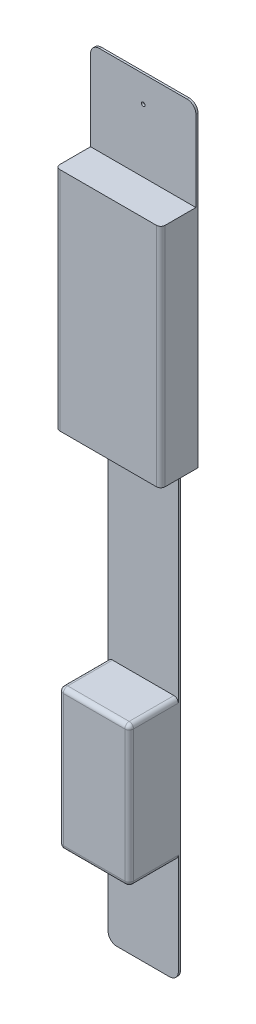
ISO-10303-21;
HEADER;
FILE_DESCRIPTION(('STEP AP214'),'2;1');
FILE_NAME('part.step','',(''),(''),'','','');
FILE_SCHEMA(('AUTOMOTIVE_DESIGN { 1 0 10303 214 1 1 1 1 }'));
ENDSEC;
DATA;
#1=APPLICATION_CONTEXT('core data for automotive mechanical design processes');
#2=APPLICATION_PROTOCOL_DEFINITION('international standard','automotive_design',2000,#1);
#3=PRODUCT_CONTEXT('',#1,'mechanical');
#4=PRODUCT('Part','Part','',(#3));
#5=PRODUCT_RELATED_PRODUCT_CATEGORY('part','',(#4));
#6=PRODUCT_DEFINITION_FORMATION('','',#4);
#7=PRODUCT_DEFINITION_CONTEXT('part definition',#1,'design');
#8=PRODUCT_DEFINITION('design','',#6,#7);
#9=PRODUCT_DEFINITION_SHAPE('','',#8);
#10=(LENGTH_UNIT() NAMED_UNIT(*) SI_UNIT(.MILLI.,.METRE.));
#11=(NAMED_UNIT(*) PLANE_ANGLE_UNIT() SI_UNIT($,.RADIAN.));
#12=(NAMED_UNIT(*) SI_UNIT($,.STERADIAN.) SOLID_ANGLE_UNIT());
#13=UNCERTAINTY_MEASURE_WITH_UNIT(LENGTH_MEASURE(1.E-05),#10,'distance_accuracy_value','');
#14=(GEOMETRIC_REPRESENTATION_CONTEXT(3) GLOBAL_UNCERTAINTY_ASSIGNED_CONTEXT((#13)) GLOBAL_UNIT_ASSIGNED_CONTEXT((#10,
#11,#12)) REPRESENTATION_CONTEXT('',''));
#15=CARTESIAN_POINT('',(0.,0.,0.));
#16=DIRECTION('',(0.,0.,1.));
#17=DIRECTION('',(1.,0.,0.));
#18=AXIS2_PLACEMENT_3D('',#15,#16,#17);
#19=CARTESIAN_POINT('',(0.,0.,1.524));
#20=DIRECTION('',(0.,0.,-1.));
#21=DIRECTION('',(-1.,0.,0.));
#22=AXIS2_PLACEMENT_3D('',#19,#20,#21);
#23=PLANE('',#22);
#24=CARTESIAN_POINT('',(0.,-501.65,1.524));
#25=DIRECTION('',(0.,0.,-1.));
#26=DIRECTION('',(-1.,0.,0.));
#27=AXIS2_PLACEMENT_3D('',#24,#25,#26);
#28=CIRCLE('',#27,1.35255);
#29=CARTESIAN_POINT('',(-1.35255,-501.65,1.524));
#30=VERTEX_POINT('',#29);
#31=EDGE_CURVE('E373',#30,#30,#28,.T.);
#32=ORIENTED_EDGE('',*,*,#31,.T.);
#33=EDGE_LOOP('',(#32));
#34=FACE_BOUND('',#33,.T.);
#35=DIRECTION('',(1.,0.,0.));
#36=VECTOR('',#35,1.);
#37=CARTESIAN_POINT('',(25.4,-480.06,1.524));
#38=LINE('',#37,#36);
#39=CARTESIAN_POINT('',(-22.225,-480.06,1.524));
#40=VERTEX_POINT('',#39);
#41=CARTESIAN_POINT('',(22.225,-480.06,1.524));
#42=VERTEX_POINT('',#41);
#43=EDGE_CURVE('E404',#40,#42,#38,.T.);
#44=ORIENTED_EDGE('',*,*,#43,.F.);
#45=CARTESIAN_POINT('',(-22.225,-476.885,1.524));
#46=DIRECTION('',(0.,0.,-1.));
#47=DIRECTION('',(-1.,0.,0.));
#48=AXIS2_PLACEMENT_3D('',#45,#46,#47);
#49=CIRCLE('',#48,3.175);
#50=CARTESIAN_POINT('',(-25.4,-476.885,1.524));
#51=VERTEX_POINT('',#50);
#52=EDGE_CURVE('E363',#40,#51,#49,.T.);
#53=ORIENTED_EDGE('',*,*,#52,.T.);
#54=DIRECTION('',(0.,-1.,0.));
#55=VECTOR('',#54,1.);
#56=CARTESIAN_POINT('',(-25.4,-556.26,1.524));
#57=LINE('',#56,#55);
#58=CARTESIAN_POINT('',(-25.4,-549.91,1.524));
#59=VERTEX_POINT('',#58);
#60=EDGE_CURVE('E238',#51,#59,#57,.T.);
#61=ORIENTED_EDGE('',*,*,#60,.T.);
#62=CARTESIAN_POINT('',(-19.05,-549.91,1.524));
#63=DIRECTION('',(0.,0.,-1.));
#64=DIRECTION('',(-1.,0.,0.));
#65=AXIS2_PLACEMENT_3D('',#62,#63,#64);
#66=CIRCLE('',#65,6.35);
#67=CARTESIAN_POINT('',(-19.05,-556.26,1.524));
#68=VERTEX_POINT('',#67);
#69=EDGE_CURVE('E298',#59,#68,#66,.F.);
#70=ORIENTED_EDGE('',*,*,#69,.T.);
#71=DIRECTION('',(1.,0.,0.));
#72=VECTOR('',#71,1.);
#73=CARTESIAN_POINT('',(25.4,-556.26,1.524));
#74=LINE('',#73,#72);
#75=CARTESIAN_POINT('',(19.05,-556.26,1.524));
#76=VERTEX_POINT('',#75);
#77=EDGE_CURVE('E237',#68,#76,#74,.T.);
#78=ORIENTED_EDGE('',*,*,#77,.T.);
#79=CARTESIAN_POINT('',(19.05,-549.91,1.524));
#80=DIRECTION('',(0.,0.,-1.));
#81=DIRECTION('',(-1.,0.,0.));
#82=AXIS2_PLACEMENT_3D('',#79,#80,#81);
#83=CIRCLE('',#82,6.35);
#84=CARTESIAN_POINT('',(25.4,-549.91,1.524));
#85=VERTEX_POINT('',#84);
#86=EDGE_CURVE('E300',#76,#85,#83,.F.);
#87=ORIENTED_EDGE('',*,*,#86,.T.);
#88=DIRECTION('',(0.,1.,0.));
#89=VECTOR('',#88,1.);
#90=CARTESIAN_POINT('',(25.4,-228.6,1.524));
#91=LINE('',#90,#89);
#92=CARTESIAN_POINT('',(25.4,-476.885,1.524));
#93=VERTEX_POINT('',#92);
#94=EDGE_CURVE('E246',#85,#93,#91,.T.);
#95=ORIENTED_EDGE('',*,*,#94,.T.);
#96=CARTESIAN_POINT('',(22.225,-476.885,1.524));
#97=DIRECTION('',(0.,0.,-1.));
#98=DIRECTION('',(-1.,0.,0.));
#99=AXIS2_PLACEMENT_3D('',#96,#97,#98);
#100=CIRCLE('',#99,3.175);
#101=EDGE_CURVE('E42',#93,#42,#100,.T.);
#102=ORIENTED_EDGE('',*,*,#101,.T.);
#103=EDGE_LOOP('',(#44,#53,#61,#70,#78,#87,#95,#102));
#104=FACE_BOUND('',#103,.T.);
#105=ADVANCED_FACE('F33',(#34,#104),#23,.F.);
#106=DIRECTION('',(-1.,0.,0.));
#107=VECTOR('',#106,1.);
#108=CARTESIAN_POINT('',(-25.4,-378.46,1.524));
#109=LINE('',#108,#107);
#110=CARTESIAN_POINT('',(22.225,-378.46,1.524));
#111=VERTEX_POINT('',#110);
#112=CARTESIAN_POINT('',(-22.225,-378.46,1.524));
#113=VERTEX_POINT('',#112);
#114=EDGE_CURVE('E409',#111,#113,#109,.T.);
#115=ORIENTED_EDGE('',*,*,#114,.F.);
#116=CARTESIAN_POINT('',(22.225,-381.635,1.524));
#117=DIRECTION('',(0.,0.,-1.));
#118=DIRECTION('',(-1.,0.,0.));
#119=AXIS2_PLACEMENT_3D('',#116,#117,#118);
#120=CIRCLE('',#119,3.175);
#121=CARTESIAN_POINT('',(25.4,-381.635,1.524));
#122=VERTEX_POINT('',#121);
#123=EDGE_CURVE('E11',#111,#122,#120,.T.);
#124=ORIENTED_EDGE('',*,*,#123,.T.);
#125=CARTESIAN_POINT('',(25.4,-228.6,1.524));
#126=VERTEX_POINT('',#125);
#127=EDGE_CURVE('E214',#122,#126,#91,.T.);
#128=ORIENTED_EDGE('',*,*,#127,.T.);
#129=DIRECTION('',(1.,0.,0.));
#130=VECTOR('',#129,1.);
#131=CARTESIAN_POINT('',(38.1000000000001,-228.6,1.524));
#132=LINE('',#131,#130);
#133=CARTESIAN_POINT('',(-25.4,-228.6,1.524));
#134=VERTEX_POINT('',#133);
#135=EDGE_CURVE('E207',#134,#126,#132,.T.);
#136=ORIENTED_EDGE('',*,*,#135,.F.);
#137=CARTESIAN_POINT('',(-25.4,-381.635,1.524));
#138=VERTEX_POINT('',#137);
#139=EDGE_CURVE('E212',#134,#138,#57,.T.);
#140=ORIENTED_EDGE('',*,*,#139,.T.);
#141=CARTESIAN_POINT('',(-22.225,-381.635,1.524));
#142=DIRECTION('',(0.,0.,-1.));
#143=DIRECTION('',(-1.,0.,0.));
#144=AXIS2_PLACEMENT_3D('',#141,#142,#143);
#145=CIRCLE('',#144,3.175);
#146=EDGE_CURVE('E366',#138,#113,#145,.T.);
#147=ORIENTED_EDGE('',*,*,#146,.T.);
#148=EDGE_LOOP('',(#115,#124,#128,#136,#140,#147));
#149=FACE_BOUND('',#148,.T.);
#150=ADVANCED_FACE('F210',(#149),#23,.F.);
#151=CARTESIAN_POINT('',(0.,-19.05,1.524));
#152=DIRECTION('',(0.,0.,-1.));
#153=DIRECTION('',(-1.,0.,0.));
#154=AXIS2_PLACEMENT_3D('',#151,#152,#153);
#155=CIRCLE('',#154,1.35255);
#156=CARTESIAN_POINT('',(-1.35255,-19.05,1.524));
#157=VERTEX_POINT('',#156);
#158=EDGE_CURVE('E561',#157,#157,#155,.T.);
#159=ORIENTED_EDGE('',*,*,#158,.T.);
#160=EDGE_LOOP('',(#159));
#161=FACE_BOUND('',#160,.T.);
#162=DIRECTION('',(-1.,0.,0.));
#163=VECTOR('',#162,1.);
#164=CARTESIAN_POINT('',(-38.1,-64.77,1.524));
#165=LINE('',#164,#163);
#166=CARTESIAN_POINT('',(38.1,-64.77,1.524));
#167=VERTEX_POINT('',#166);
#168=CARTESIAN_POINT('',(-38.1,-64.77,1.524));
#169=VERTEX_POINT('',#168);
#170=EDGE_CURVE('E415',#167,#169,#165,.T.);
#171=ORIENTED_EDGE('',*,*,#170,.F.);
#172=DIRECTION('',(0.,1.,0.));
#173=VECTOR('',#172,1.);
#174=CARTESIAN_POINT('',(38.1,0.,1.524));
#175=LINE('',#174,#173);
#176=CARTESIAN_POINT('',(38.1,-6.34999999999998,1.524));
#177=VERTEX_POINT('',#176);
#178=EDGE_CURVE('E248',#167,#177,#175,.T.);
#179=ORIENTED_EDGE('',*,*,#178,.T.);
#180=CARTESIAN_POINT('',(31.75,-6.34999999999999,1.524));
#181=DIRECTION('',(0.,0.,-1.));
#182=DIRECTION('',(-1.,0.,0.));
#183=AXIS2_PLACEMENT_3D('',#180,#181,#182);
#184=CIRCLE('',#183,6.35);
#185=CARTESIAN_POINT('',(31.75,0.,1.524));
#186=VERTEX_POINT('',#185);
#187=EDGE_CURVE('E294',#177,#186,#184,.F.);
#188=ORIENTED_EDGE('',*,*,#187,.T.);
#189=DIRECTION('',(-1.,0.,0.));
#190=VECTOR('',#189,1.);
#191=CARTESIAN_POINT('',(-38.1,0.,1.524));
#192=LINE('',#191,#190);
#193=CARTESIAN_POINT('',(-31.75,0.,1.524));
#194=VERTEX_POINT('',#193);
#195=EDGE_CURVE('E250',#186,#194,#192,.T.);
#196=ORIENTED_EDGE('',*,*,#195,.T.);
#197=CARTESIAN_POINT('',(-31.75,-6.34999999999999,1.524));
#198=DIRECTION('',(0.,0.,-1.));
#199=DIRECTION('',(-1.,0.,0.));
#200=AXIS2_PLACEMENT_3D('',#197,#198,#199);
#201=CIRCLE('',#200,6.35);
#202=CARTESIAN_POINT('',(-38.1,-6.34999999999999,1.524));
#203=VERTEX_POINT('',#202);
#204=EDGE_CURVE('E296',#194,#203,#201,.F.);
#205=ORIENTED_EDGE('',*,*,#204,.T.);
#206=DIRECTION('',(0.,-1.,0.));
#207=VECTOR('',#206,1.);
#208=CARTESIAN_POINT('',(-38.1,-228.6,1.524));
#209=LINE('',#208,#207);
#210=EDGE_CURVE('E242',#203,#169,#209,.T.);
#211=ORIENTED_EDGE('',*,*,#210,.T.);
#212=EDGE_LOOP('',(#171,#179,#188,#196,#205,#211));
#213=FACE_BOUND('',#212,.T.);
#214=ADVANCED_FACE('F440',(#161,#213),#23,.F.);
#215=CARTESIAN_POINT('',(-38.1,-228.6,1.524));
#216=DIRECTION('',(1.,0.,0.));
#217=DIRECTION('',(0.,0.,-1.));
#218=AXIS2_PLACEMENT_3D('',#215,#216,#217);
#219=PLANE('',#218);
#220=DIRECTION('',(0.,0.,-1.));
#221=VECTOR('',#220,1.);
#222=CARTESIAN_POINT('',(-38.1,-228.6,1.524));
#223=LINE('',#222,#221);
#224=CARTESIAN_POINT('',(-38.1,-228.6,23.749));
#225=VERTEX_POINT('',#224);
#226=CARTESIAN_POINT('',(-38.1,-228.6,0.));
#227=VERTEX_POINT('',#226);
#228=EDGE_CURVE('E230',#225,#227,#223,.T.);
#229=ORIENTED_EDGE('',*,*,#228,.F.);
#230=DIRECTION('',(0.,-1.,0.));
#231=VECTOR('',#230,1.);
#232=CARTESIAN_POINT('',(-38.1,-228.6,23.749));
#233=LINE('',#232,#231);
#234=CARTESIAN_POINT('',(-38.1,-64.77,23.749));
#235=VERTEX_POINT('',#234);
#236=EDGE_CURVE('E330',#225,#235,#233,.F.);
#237=ORIENTED_EDGE('',*,*,#236,.T.);
#238=DIRECTION('',(0.,0.,-1.));
#239=VECTOR('',#238,1.);
#240=CARTESIAN_POINT('',(-38.1,-64.77,26.924));
#241=LINE('',#240,#239);
#242=EDGE_CURVE('E425',#235,#169,#241,.T.);
#243=ORIENTED_EDGE('',*,*,#242,.T.);
#244=ORIENTED_EDGE('',*,*,#210,.F.);
#245=DIRECTION('',(0.,0.,-1.));
#246=VECTOR('',#245,1.);
#247=CARTESIAN_POINT('',(-38.1,-6.34999999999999,1.524));
#248=LINE('',#247,#246);
#249=CARTESIAN_POINT('',(-38.1,-6.34999999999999,0.));
#250=VERTEX_POINT('',#249);
#251=EDGE_CURVE('E305',#203,#250,#248,.T.);
#252=ORIENTED_EDGE('',*,*,#251,.T.);
#253=DIRECTION('',(0.,-1.,0.));
#254=VECTOR('',#253,1.);
#255=CARTESIAN_POINT('',(-38.1,-228.6,0.));
#256=LINE('',#255,#254);
#257=EDGE_CURVE('E254',#250,#227,#256,.T.);
#258=ORIENTED_EDGE('',*,*,#257,.T.);
#259=EDGE_LOOP('',(#229,#237,#243,#244,#252,#258));
#260=FACE_BOUND('',#259,.T.);
#261=ADVANCED_FACE('F460',(#260),#219,.F.);
#262=CARTESIAN_POINT('',(-25.4,-556.26,1.524));
#263=DIRECTION('',(1.,0.,0.));
#264=DIRECTION('',(0.,0.,-1.));
#265=AXIS2_PLACEMENT_3D('',#262,#263,#264);
#266=PLANE('',#265);
#267=DIRECTION('',(0.,0.,-1.));
#268=VECTOR('',#267,1.);
#269=CARTESIAN_POINT('',(-25.4,-381.635,1.524));
#270=LINE('',#269,#268);
#271=CARTESIAN_POINT('',(-25.4,-381.635,33.909));
#272=VERTEX_POINT('',#271);
#273=EDGE_CURVE('E235',#272,#138,#270,.T.);
#274=ORIENTED_EDGE('',*,*,#273,.T.);
#275=ORIENTED_EDGE('',*,*,#139,.F.);
#276=DIRECTION('',(0.,0.,-1.));
#277=VECTOR('',#276,1.);
#278=CARTESIAN_POINT('',(-25.4,-228.6,1.524));
#279=LINE('',#278,#277);
#280=CARTESIAN_POINT('',(-25.4,-228.6,0.));
#281=VERTEX_POINT('',#280);
#282=EDGE_CURVE('E222',#134,#281,#279,.T.);
#283=ORIENTED_EDGE('',*,*,#282,.T.);
#284=DIRECTION('',(0.,-1.,0.));
#285=VECTOR('',#284,1.);
#286=CARTESIAN_POINT('',(-25.4,-556.26,0.));
#287=LINE('',#286,#285);
#288=CARTESIAN_POINT('',(-25.4,-549.91,0.));
#289=VERTEX_POINT('',#288);
#290=EDGE_CURVE('E259',#281,#289,#287,.T.);
#291=ORIENTED_EDGE('',*,*,#290,.T.);
#292=DIRECTION('',(0.,0.,-1.));
#293=VECTOR('',#292,1.);
#294=CARTESIAN_POINT('',(-25.4,-549.91,1.524));
#295=LINE('',#294,#293);
#296=EDGE_CURVE('E302',#289,#59,#295,.F.);
#297=ORIENTED_EDGE('',*,*,#296,.T.);
#298=ORIENTED_EDGE('',*,*,#60,.F.);
#299=DIRECTION('',(0.,0.,-1.));
#300=VECTOR('',#299,1.);
#301=CARTESIAN_POINT('',(-25.4,-476.885,1.524));
#302=LINE('',#301,#300);
#303=CARTESIAN_POINT('',(-25.4,-476.885,33.909));
#304=VERTEX_POINT('',#303);
#305=EDGE_CURVE('E342',#51,#304,#302,.F.);
#306=ORIENTED_EDGE('',*,*,#305,.T.);
#307=DIRECTION('',(0.,-1.,0.));
#308=VECTOR('',#307,1.);
#309=CARTESIAN_POINT('',(-25.4,-556.26,33.909));
#310=LINE('',#309,#308);
#311=EDGE_CURVE('E339',#304,#272,#310,.F.);
#312=ORIENTED_EDGE('',*,*,#311,.T.);
#313=EDGE_LOOP('',(#274,#275,#283,#291,#297,#298,#306,#312));
#314=FACE_BOUND('',#313,.T.);
#315=ADVANCED_FACE('F233',(#314),#266,.F.);
#316=CARTESIAN_POINT('',(25.4,-556.26,1.524));
#317=DIRECTION('',(0.,1.,0.));
#318=DIRECTION('',(0.,0.,1.));
#319=AXIS2_PLACEMENT_3D('',#316,#317,#318);
#320=PLANE('',#319);
#321=DIRECTION('',(1.,0.,0.));
#322=VECTOR('',#321,1.);
#323=CARTESIAN_POINT('',(25.4,-556.26,0.));
#324=LINE('',#323,#322);
#325=CARTESIAN_POINT('',(-19.05,-556.26,0.));
#326=VERTEX_POINT('',#325);
#327=CARTESIAN_POINT('',(19.05,-556.26,0.));
#328=VERTEX_POINT('',#327);
#329=EDGE_CURVE('E261',#326,#328,#324,.T.);
#330=ORIENTED_EDGE('',*,*,#329,.T.);
#331=DIRECTION('',(0.,0.,-1.));
#332=VECTOR('',#331,1.);
#333=CARTESIAN_POINT('',(19.05,-556.26,1.524));
#334=LINE('',#333,#332);
#335=EDGE_CURVE('E292',#328,#76,#334,.F.);
#336=ORIENTED_EDGE('',*,*,#335,.T.);
#337=ORIENTED_EDGE('',*,*,#77,.F.);
#338=DIRECTION('',(0.,0.,-1.));
#339=VECTOR('',#338,1.);
#340=CARTESIAN_POINT('',(-19.05,-556.26,1.524));
#341=LINE('',#340,#339);
#342=EDGE_CURVE('E289',#68,#326,#341,.T.);
#343=ORIENTED_EDGE('',*,*,#342,.T.);
#344=EDGE_LOOP('',(#330,#336,#337,#343));
#345=FACE_BOUND('',#344,.T.);
#346=ADVANCED_FACE('F488',(#345),#320,.F.);
#347=CARTESIAN_POINT('',(25.4,-228.6,1.524));
#348=DIRECTION('',(-1.,0.,0.));
#349=DIRECTION('',(0.,-1.,0.));
#350=AXIS2_PLACEMENT_3D('',#347,#348,#349);
#351=PLANE('',#350);
#352=DIRECTION('',(0.,0.,-1.));
#353=VECTOR('',#352,1.);
#354=CARTESIAN_POINT('',(25.4,-476.885,1.524));
#355=LINE('',#354,#353);
#356=CARTESIAN_POINT('',(25.4,-476.885,33.909));
#357=VERTEX_POINT('',#356);
#358=EDGE_CURVE('E354',#357,#93,#355,.T.);
#359=ORIENTED_EDGE('',*,*,#358,.T.);
#360=ORIENTED_EDGE('',*,*,#94,.F.);
#361=DIRECTION('',(0.,0.,-1.));
#362=VECTOR('',#361,1.);
#363=CARTESIAN_POINT('',(25.4,-549.91,1.524));
#364=LINE('',#363,#362);
#365=CARTESIAN_POINT('',(25.4,-549.91,0.));
#366=VERTEX_POINT('',#365);
#367=EDGE_CURVE('E278',#85,#366,#364,.T.);
#368=ORIENTED_EDGE('',*,*,#367,.T.);
#369=DIRECTION('',(0.,1.,0.));
#370=VECTOR('',#369,1.);
#371=CARTESIAN_POINT('',(25.4,-228.6,0.));
#372=LINE('',#371,#370);
#373=CARTESIAN_POINT('',(25.4,-228.6,0.));
#374=VERTEX_POINT('',#373);
#375=EDGE_CURVE('E264',#366,#374,#372,.T.);
#376=ORIENTED_EDGE('',*,*,#375,.T.);
#377=DIRECTION('',(0.,0.,-1.));
#378=VECTOR('',#377,1.);
#379=CARTESIAN_POINT('',(25.4,-228.6,1.524));
#380=LINE('',#379,#378);
#381=EDGE_CURVE('E231',#126,#374,#380,.T.);
#382=ORIENTED_EDGE('',*,*,#381,.F.);
#383=ORIENTED_EDGE('',*,*,#127,.F.);
#384=DIRECTION('',(0.,0.,-1.));
#385=VECTOR('',#384,1.);
#386=CARTESIAN_POINT('',(25.4,-381.635,1.524));
#387=LINE('',#386,#385);
#388=CARTESIAN_POINT('',(25.4,-381.635,33.909));
#389=VERTEX_POINT('',#388);
#390=EDGE_CURVE('E350',#122,#389,#387,.F.);
#391=ORIENTED_EDGE('',*,*,#390,.T.);
#392=DIRECTION('',(0.,1.,0.));
#393=VECTOR('',#392,1.);
#394=CARTESIAN_POINT('',(25.4,-228.6,33.909));
#395=LINE('',#394,#393);
#396=EDGE_CURVE('E352',#389,#357,#395,.F.);
#397=ORIENTED_EDGE('',*,*,#396,.T.);
#398=EDGE_LOOP('',(#359,#360,#368,#376,#382,#383,#391,#397));
#399=FACE_BOUND('',#398,.T.);
#400=ADVANCED_FACE('F495',(#399),#351,.F.);
#401=CARTESIAN_POINT('',(38.1000000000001,-228.6,1.524));
#402=DIRECTION('',(0.,1.,0.));
#403=DIRECTION('',(-1.,0.,0.));
#404=AXIS2_PLACEMENT_3D('',#401,#402,#403);
#405=PLANE('',#404);
#406=DIRECTION('',(0.,0.,-1.));
#407=VECTOR('',#406,1.);
#408=CARTESIAN_POINT('',(38.1000000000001,-228.6,1.524));
#409=LINE('',#408,#407);
#410=CARTESIAN_POINT('',(38.1000000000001,-228.6,23.749));
#411=VERTEX_POINT('',#410);
#412=CARTESIAN_POINT('',(38.1000000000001,-228.6,0.));
#413=VERTEX_POINT('',#412);
#414=EDGE_CURVE('E253',#411,#413,#409,.T.);
#415=ORIENTED_EDGE('',*,*,#414,.F.);
#416=CARTESIAN_POINT('',(34.9250000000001,-228.6,23.749));
#417=DIRECTION('',(0.,1.,0.));
#418=DIRECTION('',(-1.,0.,0.));
#419=AXIS2_PLACEMENT_3D('',#416,#417,#418);
#420=CIRCLE('',#419,3.175);
#421=CARTESIAN_POINT('',(34.9250000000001,-228.6,26.924));
#422=VERTEX_POINT('',#421);
#423=EDGE_CURVE('E328',#411,#422,#420,.F.);
#424=ORIENTED_EDGE('',*,*,#423,.T.);
#425=DIRECTION('',(1.,0.,0.));
#426=VECTOR('',#425,1.);
#427=CARTESIAN_POINT('',(38.1000000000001,-228.6,26.924));
#428=LINE('',#427,#426);
#429=CARTESIAN_POINT('',(-34.925,-228.6,26.924));
#430=VERTEX_POINT('',#429);
#431=EDGE_CURVE('E420',#430,#422,#428,.T.);
#432=ORIENTED_EDGE('',*,*,#431,.F.);
#433=CARTESIAN_POINT('',(-34.925,-228.6,23.749));
#434=DIRECTION('',(0.,1.,0.));
#435=DIRECTION('',(-1.,0.,0.));
#436=AXIS2_PLACEMENT_3D('',#433,#434,#435);
#437=CIRCLE('',#436,3.175);
#438=EDGE_CURVE('E326',#430,#225,#437,.F.);
#439=ORIENTED_EDGE('',*,*,#438,.T.);
#440=ORIENTED_EDGE('',*,*,#228,.T.);
#441=DIRECTION('',(1.,0.,0.));
#442=VECTOR('',#441,1.);
#443=CARTESIAN_POINT('',(-25.4,-228.6,0.));
#444=LINE('',#443,#442);
#445=EDGE_CURVE('E226',#227,#281,#444,.T.);
#446=ORIENTED_EDGE('',*,*,#445,.T.);
#447=ORIENTED_EDGE('',*,*,#282,.F.);
#448=ORIENTED_EDGE('',*,*,#135,.T.);
#449=ORIENTED_EDGE('',*,*,#381,.T.);
#450=DIRECTION('',(1.,0.,0.));
#451=VECTOR('',#450,1.);
#452=CARTESIAN_POINT('',(38.1000000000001,-228.6,0.));
#453=LINE('',#452,#451);
#454=EDGE_CURVE('E266',#374,#413,#453,.T.);
#455=ORIENTED_EDGE('',*,*,#454,.T.);
#456=EDGE_LOOP('',(#415,#424,#432,#439,#440,#446,#447,#448,#449,#455));
#457=FACE_BOUND('',#456,.T.);
#458=ADVANCED_FACE('F224',(#457),#405,.F.);
#459=CARTESIAN_POINT('',(38.1,0.,1.524));
#460=DIRECTION('',(-1.,0.,0.));
#461=DIRECTION('',(0.,-1.,0.));
#462=AXIS2_PLACEMENT_3D('',#459,#460,#461);
#463=PLANE('',#462);
#464=DIRECTION('',(0.,0.,-1.));
#465=VECTOR('',#464,1.);
#466=CARTESIAN_POINT('',(38.1000000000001,-64.77,26.924));
#467=LINE('',#466,#465);
#468=CARTESIAN_POINT('',(38.1000000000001,-64.77,23.749));
#469=VERTEX_POINT('',#468);
#470=EDGE_CURVE('E257',#469,#167,#467,.T.);
#471=ORIENTED_EDGE('',*,*,#470,.F.);
#472=DIRECTION('',(0.,1.,0.));
#473=VECTOR('',#472,1.);
#474=CARTESIAN_POINT('',(38.1,0.,23.749));
#475=LINE('',#474,#473);
#476=EDGE_CURVE('E324',#469,#411,#475,.F.);
#477=ORIENTED_EDGE('',*,*,#476,.T.);
#478=ORIENTED_EDGE('',*,*,#414,.T.);
#479=DIRECTION('',(0.,1.,0.));
#480=VECTOR('',#479,1.);
#481=CARTESIAN_POINT('',(38.1,0.,0.));
#482=LINE('',#481,#480);
#483=CARTESIAN_POINT('',(38.1,-6.34999999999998,0.));
#484=VERTEX_POINT('',#483);
#485=EDGE_CURVE('E269',#413,#484,#482,.T.);
#486=ORIENTED_EDGE('',*,*,#485,.T.);
#487=DIRECTION('',(0.,0.,-1.));
#488=VECTOR('',#487,1.);
#489=CARTESIAN_POINT('',(38.1,-6.34999999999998,1.524));
#490=LINE('',#489,#488);
#491=EDGE_CURVE('E219',#484,#177,#490,.F.);
#492=ORIENTED_EDGE('',*,*,#491,.T.);
#493=ORIENTED_EDGE('',*,*,#178,.F.);
#494=EDGE_LOOP('',(#471,#477,#478,#486,#492,#493));
#495=FACE_BOUND('',#494,.T.);
#496=ADVANCED_FACE('F442',(#495),#463,.F.);
#497=CARTESIAN_POINT('',(-38.1,0.,1.524));
#498=DIRECTION('',(0.,-1.,0.));
#499=DIRECTION('',(1.,0.,0.));
#500=AXIS2_PLACEMENT_3D('',#497,#498,#499);
#501=PLANE('',#500);
#502=DIRECTION('',(-1.,0.,0.));
#503=VECTOR('',#502,1.);
#504=CARTESIAN_POINT('',(-38.1,0.,0.));
#505=LINE('',#504,#503);
#506=CARTESIAN_POINT('',(31.75,0.,0.));
#507=VERTEX_POINT('',#506);
#508=CARTESIAN_POINT('',(-31.75,0.,0.));
#509=VERTEX_POINT('',#508);
#510=EDGE_CURVE('E272',#507,#509,#505,.T.);
#511=ORIENTED_EDGE('',*,*,#510,.T.);
#512=DIRECTION('',(0.,0.,-1.));
#513=VECTOR('',#512,1.);
#514=CARTESIAN_POINT('',(-31.75,0.,1.524));
#515=LINE('',#514,#513);
#516=EDGE_CURVE('E311',#509,#194,#515,.F.);
#517=ORIENTED_EDGE('',*,*,#516,.T.);
#518=ORIENTED_EDGE('',*,*,#195,.F.);
#519=DIRECTION('',(0.,0.,-1.));
#520=VECTOR('',#519,1.);
#521=CARTESIAN_POINT('',(31.75,0.,1.524));
#522=LINE('',#521,#520);
#523=EDGE_CURVE('E308',#186,#507,#522,.T.);
#524=ORIENTED_EDGE('',*,*,#523,.T.);
#525=EDGE_LOOP('',(#511,#517,#518,#524));
#526=FACE_BOUND('',#525,.T.);
#527=ADVANCED_FACE('F452',(#526),#501,.F.);
#528=CARTESIAN_POINT('',(0.,0.,0.));
#529=DIRECTION('',(0.,0.,-1.));
#530=DIRECTION('',(-1.,0.,0.));
#531=AXIS2_PLACEMENT_3D('',#528,#529,#530);
#532=PLANE('',#531);
#533=CARTESIAN_POINT('',(0.,-19.05,0.));
#534=DIRECTION('',(0.,0.,-1.));
#535=DIRECTION('',(-1.,0.,0.));
#536=AXIS2_PLACEMENT_3D('',#533,#534,#535);
#537=CIRCLE('',#536,1.35255);
#538=CARTESIAN_POINT('',(-1.35255,-19.05,0.));
#539=VERTEX_POINT('',#538);
#540=EDGE_CURVE('E564',#539,#539,#537,.T.);
#541=ORIENTED_EDGE('',*,*,#540,.F.);
#542=EDGE_LOOP('',(#541));
#543=FACE_BOUND('',#542,.T.);
#544=CARTESIAN_POINT('',(0.,-501.65,0.));
#545=DIRECTION('',(0.,0.,-1.));
#546=DIRECTION('',(-1.,0.,0.));
#547=AXIS2_PLACEMENT_3D('',#544,#545,#546);
#548=CIRCLE('',#547,1.35255);
#549=CARTESIAN_POINT('',(-1.35255,-501.65,0.));
#550=VERTEX_POINT('',#549);
#551=EDGE_CURVE('E563',#550,#550,#548,.T.);
#552=ORIENTED_EDGE('',*,*,#551,.F.);
#553=EDGE_LOOP('',(#552));
#554=FACE_BOUND('',#553,.T.);
#555=ORIENTED_EDGE('',*,*,#375,.F.);
#556=CARTESIAN_POINT('',(19.05,-549.91,0.));
#557=DIRECTION('',(0.,0.,-1.));
#558=DIRECTION('',(-1.,0.,0.));
#559=AXIS2_PLACEMENT_3D('',#556,#557,#558);
#560=CIRCLE('',#559,6.35);
#561=EDGE_CURVE('E287',#366,#328,#560,.T.);
#562=ORIENTED_EDGE('',*,*,#561,.T.);
#563=ORIENTED_EDGE('',*,*,#329,.F.);
#564=CARTESIAN_POINT('',(-19.05,-549.91,0.));
#565=DIRECTION('',(0.,0.,-1.));
#566=DIRECTION('',(-1.,0.,0.));
#567=AXIS2_PLACEMENT_3D('',#564,#565,#566);
#568=CIRCLE('',#567,6.35);
#569=EDGE_CURVE('E285',#326,#289,#568,.T.);
#570=ORIENTED_EDGE('',*,*,#569,.T.);
#571=ORIENTED_EDGE('',*,*,#290,.F.);
#572=ORIENTED_EDGE('',*,*,#445,.F.);
#573=ORIENTED_EDGE('',*,*,#257,.F.);
#574=CARTESIAN_POINT('',(-31.75,-6.34999999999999,0.));
#575=DIRECTION('',(0.,0.,-1.));
#576=DIRECTION('',(-1.,0.,0.));
#577=AXIS2_PLACEMENT_3D('',#574,#575,#576);
#578=CIRCLE('',#577,6.35);
#579=EDGE_CURVE('E283',#250,#509,#578,.T.);
#580=ORIENTED_EDGE('',*,*,#579,.T.);
#581=ORIENTED_EDGE('',*,*,#510,.F.);
#582=CARTESIAN_POINT('',(31.75,-6.34999999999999,0.));
#583=DIRECTION('',(0.,0.,-1.));
#584=DIRECTION('',(-1.,0.,0.));
#585=AXIS2_PLACEMENT_3D('',#582,#583,#584);
#586=CIRCLE('',#585,6.35);
#587=EDGE_CURVE('E281',#507,#484,#586,.T.);
#588=ORIENTED_EDGE('',*,*,#587,.T.);
#589=ORIENTED_EDGE('',*,*,#485,.F.);
#590=ORIENTED_EDGE('',*,*,#454,.F.);
#591=EDGE_LOOP('',(#555,#562,#563,#570,#571,#572,#573,#580,#581,#588,#589,#590));
#592=FACE_BOUND('',#591,.T.);
#593=ADVANCED_FACE('F477',(#543,#554,#592),#532,.T.);
#594=CARTESIAN_POINT('',(19.05,-549.91,1.524));
#595=DIRECTION('',(0.,0.,-1.));
#596=DIRECTION('',(-1.,0.,0.));
#597=AXIS2_PLACEMENT_3D('',#594,#595,#596);
#598=CYLINDRICAL_SURFACE('',#597,6.35);
#599=ORIENTED_EDGE('',*,*,#86,.F.);
#600=ORIENTED_EDGE('',*,*,#335,.F.);
#601=ORIENTED_EDGE('',*,*,#561,.F.);
#602=ORIENTED_EDGE('',*,*,#367,.F.);
#603=EDGE_LOOP('',(#599,#600,#601,#602));
#604=FACE_BOUND('',#603,.T.);
#605=ADVANCED_FACE('F491',(#604),#598,.T.);
#606=CARTESIAN_POINT('',(-19.05,-549.91,1.524));
#607=DIRECTION('',(0.,0.,-1.));
#608=DIRECTION('',(-1.,0.,0.));
#609=AXIS2_PLACEMENT_3D('',#606,#607,#608);
#610=CYLINDRICAL_SURFACE('',#609,6.35);
#611=ORIENTED_EDGE('',*,*,#69,.F.);
#612=ORIENTED_EDGE('',*,*,#296,.F.);
#613=ORIENTED_EDGE('',*,*,#569,.F.);
#614=ORIENTED_EDGE('',*,*,#342,.F.);
#615=EDGE_LOOP('',(#611,#612,#613,#614));
#616=FACE_BOUND('',#615,.T.);
#617=ADVANCED_FACE('F482',(#616),#610,.T.);
#618=CARTESIAN_POINT('',(-31.75,-6.34999999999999,1.524));
#619=DIRECTION('',(0.,0.,-1.));
#620=DIRECTION('',(-1.,0.,0.));
#621=AXIS2_PLACEMENT_3D('',#618,#619,#620);
#622=CYLINDRICAL_SURFACE('',#621,6.35);
#623=ORIENTED_EDGE('',*,*,#204,.F.);
#624=ORIENTED_EDGE('',*,*,#516,.F.);
#625=ORIENTED_EDGE('',*,*,#579,.F.);
#626=ORIENTED_EDGE('',*,*,#251,.F.);
#627=EDGE_LOOP('',(#623,#624,#625,#626));
#628=FACE_BOUND('',#627,.T.);
#629=ADVANCED_FACE('F456',(#628),#622,.T.);
#630=CARTESIAN_POINT('',(31.75,-6.34999999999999,1.524));
#631=DIRECTION('',(0.,0.,-1.));
#632=DIRECTION('',(-1.,0.,0.));
#633=AXIS2_PLACEMENT_3D('',#630,#631,#632);
#634=CYLINDRICAL_SURFACE('',#633,6.35);
#635=ORIENTED_EDGE('',*,*,#187,.F.);
#636=ORIENTED_EDGE('',*,*,#491,.F.);
#637=ORIENTED_EDGE('',*,*,#587,.F.);
#638=ORIENTED_EDGE('',*,*,#523,.F.);
#639=EDGE_LOOP('',(#635,#636,#637,#638));
#640=FACE_BOUND('',#639,.T.);
#641=ADVANCED_FACE('F448',(#640),#634,.T.);
#642=CARTESIAN_POINT('',(-38.1,-64.77,26.924));
#643=DIRECTION('',(0.,-1.,0.));
#644=DIRECTION('',(0.,0.,-1.));
#645=AXIS2_PLACEMENT_3D('',#642,#643,#644);
#646=PLANE('',#645);
#647=DIRECTION('',(-1.,0.,0.));
#648=VECTOR('',#647,1.);
#649=CARTESIAN_POINT('',(-38.1,-64.77,26.924));
#650=LINE('',#649,#648);
#651=CARTESIAN_POINT('',(34.925,-64.77,26.924));
#652=VERTEX_POINT('',#651);
#653=CARTESIAN_POINT('',(-34.925,-64.77,26.924));
#654=VERTEX_POINT('',#653);
#655=EDGE_CURVE('E423',#652,#654,#650,.T.);
#656=ORIENTED_EDGE('',*,*,#655,.F.);
#657=CARTESIAN_POINT('',(34.925,-64.77,23.749));
#658=DIRECTION('',(0.,-1.,0.));
#659=DIRECTION('',(0.,0.,-1.));
#660=AXIS2_PLACEMENT_3D('',#657,#658,#659);
#661=CIRCLE('',#660,3.175);
#662=EDGE_CURVE('E322',#652,#469,#661,.F.);
#663=ORIENTED_EDGE('',*,*,#662,.T.);
#664=ORIENTED_EDGE('',*,*,#470,.T.);
#665=ORIENTED_EDGE('',*,*,#170,.T.);
#666=ORIENTED_EDGE('',*,*,#242,.F.);
#667=CARTESIAN_POINT('',(-34.925,-64.77,23.749));
#668=DIRECTION('',(0.,-1.,0.));
#669=DIRECTION('',(0.,0.,-1.));
#670=AXIS2_PLACEMENT_3D('',#667,#668,#669);
#671=CIRCLE('',#670,3.175);
#672=EDGE_CURVE('E320',#235,#654,#671,.F.);
#673=ORIENTED_EDGE('',*,*,#672,.T.);
#674=EDGE_LOOP('',(#656,#663,#664,#665,#666,#673));
#675=FACE_BOUND('',#674,.T.);
#676=ADVANCED_FACE('F433',(#675),#646,.F.);
#677=CARTESIAN_POINT('',(0.,0.,26.924));
#678=DIRECTION('',(0.,0.,-1.));
#679=DIRECTION('',(-1.,0.,0.));
#680=AXIS2_PLACEMENT_3D('',#677,#678,#679);
#681=PLANE('',#680);
#682=ORIENTED_EDGE('',*,*,#431,.T.);
#683=DIRECTION('',(0.,1.,0.));
#684=VECTOR('',#683,1.);
#685=CARTESIAN_POINT('',(34.925,0.,26.924));
#686=LINE('',#685,#684);
#687=EDGE_CURVE('E317',#422,#652,#686,.T.);
#688=ORIENTED_EDGE('',*,*,#687,.T.);
#689=ORIENTED_EDGE('',*,*,#655,.T.);
#690=DIRECTION('',(0.,-1.,0.));
#691=VECTOR('',#690,1.);
#692=CARTESIAN_POINT('',(-34.925,0.,26.924));
#693=LINE('',#692,#691);
#694=EDGE_CURVE('E218',#654,#430,#693,.T.);
#695=ORIENTED_EDGE('',*,*,#694,.T.);
#696=EDGE_LOOP('',(#682,#688,#689,#695));
#697=FACE_BOUND('',#696,.T.);
#698=ADVANCED_FACE('F469',(#697),#681,.F.);
#699=CARTESIAN_POINT('',(25.4,-480.06,37.084));
#700=DIRECTION('',(0.,1.,0.));
#701=DIRECTION('',(-1.,0.,0.));
#702=AXIS2_PLACEMENT_3D('',#699,#700,#701);
#703=PLANE('',#702);
#704=DIRECTION('',(1.,0.,0.));
#705=VECTOR('',#704,1.);
#706=CARTESIAN_POINT('',(25.4,-480.06,33.909));
#707=LINE('',#706,#705);
#708=CARTESIAN_POINT('',(22.225,-480.06,33.909));
#709=VERTEX_POINT('',#708);
#710=CARTESIAN_POINT('',(-22.225,-480.06,33.909));
#711=VERTEX_POINT('',#710);
#712=EDGE_CURVE('E332',#709,#711,#707,.F.);
#713=ORIENTED_EDGE('',*,*,#712,.T.);
#714=DIRECTION('',(0.,0.,-1.));
#715=VECTOR('',#714,1.);
#716=CARTESIAN_POINT('',(-22.225,-480.06,37.084));
#717=LINE('',#716,#715);
#718=EDGE_CURVE('E336',#711,#40,#717,.T.);
#719=ORIENTED_EDGE('',*,*,#718,.T.);
#720=ORIENTED_EDGE('',*,*,#43,.T.);
#721=DIRECTION('',(0.,0.,-1.));
#722=VECTOR('',#721,1.);
#723=CARTESIAN_POINT('',(22.225,-480.06,37.084));
#724=LINE('',#723,#722);
#725=EDGE_CURVE('E334',#42,#709,#724,.F.);
#726=ORIENTED_EDGE('',*,*,#725,.T.);
#727=EDGE_LOOP('',(#713,#719,#720,#726));
#728=FACE_BOUND('',#727,.T.);
#729=ADVANCED_FACE('F593',(#728),#703,.F.);
#730=CARTESIAN_POINT('',(-25.4,-378.46,37.084));
#731=DIRECTION('',(0.,-1.,0.));
#732=DIRECTION('',(0.,0.,-1.));
#733=AXIS2_PLACEMENT_3D('',#730,#731,#732);
#734=PLANE('',#733);
#735=ORIENTED_EDGE('',*,*,#114,.T.);
#736=DIRECTION('',(0.,0.,-1.));
#737=VECTOR('',#736,1.);
#738=CARTESIAN_POINT('',(-22.225,-378.46,37.084));
#739=LINE('',#738,#737);
#740=CARTESIAN_POINT('',(-22.225,-378.46,33.909));
#741=VERTEX_POINT('',#740);
#742=EDGE_CURVE('E348',#113,#741,#739,.F.);
#743=ORIENTED_EDGE('',*,*,#742,.T.);
#744=DIRECTION('',(-1.,0.,0.));
#745=VECTOR('',#744,1.);
#746=CARTESIAN_POINT('',(-25.4,-378.46,33.909));
#747=LINE('',#746,#745);
#748=CARTESIAN_POINT('',(22.225,-378.46,33.909));
#749=VERTEX_POINT('',#748);
#750=EDGE_CURVE('E346',#741,#749,#747,.F.);
#751=ORIENTED_EDGE('',*,*,#750,.T.);
#752=DIRECTION('',(0.,0.,-1.));
#753=VECTOR('',#752,1.);
#754=CARTESIAN_POINT('',(22.225,-378.46,37.084));
#755=LINE('',#754,#753);
#756=EDGE_CURVE('E344',#749,#111,#755,.T.);
#757=ORIENTED_EDGE('',*,*,#756,.T.);
#758=EDGE_LOOP('',(#735,#743,#751,#757));
#759=FACE_BOUND('',#758,.T.);
#760=ADVANCED_FACE('F534',(#759),#734,.F.);
#761=CARTESIAN_POINT('',(0.,0.,37.084));
#762=DIRECTION('',(0.,0.,-1.));
#763=DIRECTION('',(-1.,0.,0.));
#764=AXIS2_PLACEMENT_3D('',#761,#762,#763);
#765=PLANE('',#764);
#766=DIRECTION('',(0.,-1.,0.));
#767=VECTOR('',#766,1.);
#768=CARTESIAN_POINT('',(-22.225,0.,37.084));
#769=LINE('',#768,#767);
#770=CARTESIAN_POINT('',(-22.225,-381.635,37.084));
#771=VERTEX_POINT('',#770);
#772=CARTESIAN_POINT('',(-22.225,-476.885,37.084));
#773=VERTEX_POINT('',#772);
#774=EDGE_CURVE('E50',#771,#773,#769,.T.);
#775=ORIENTED_EDGE('',*,*,#774,.T.);
#776=DIRECTION('',(1.,0.,0.));
#777=VECTOR('',#776,1.);
#778=CARTESIAN_POINT('',(5.21110932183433E-13,-476.885,37.084));
#779=LINE('',#778,#777);
#780=CARTESIAN_POINT('',(22.225,-476.885,37.084));
#781=VERTEX_POINT('',#780);
#782=EDGE_CURVE('E361',#773,#781,#779,.T.);
#783=ORIENTED_EDGE('',*,*,#782,.T.);
#784=DIRECTION('',(0.,1.,0.));
#785=VECTOR('',#784,1.);
#786=CARTESIAN_POINT('',(22.2249999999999,0.,37.084));
#787=LINE('',#786,#785);
#788=CARTESIAN_POINT('',(22.225,-381.635,37.084));
#789=VERTEX_POINT('',#788);
#790=EDGE_CURVE('E357',#781,#789,#787,.T.);
#791=ORIENTED_EDGE('',*,*,#790,.T.);
#792=DIRECTION('',(-1.,0.,0.));
#793=VECTOR('',#792,1.);
#794=CARTESIAN_POINT('',(0.,-381.635,37.084));
#795=LINE('',#794,#793);
#796=EDGE_CURVE('E55',#789,#771,#795,.T.);
#797=ORIENTED_EDGE('',*,*,#796,.T.);
#798=EDGE_LOOP('',(#775,#783,#791,#797));
#799=FACE_BOUND('',#798,.T.);
#800=ADVANCED_FACE('F520',(#799),#765,.F.);
#801=CARTESIAN_POINT('',(34.925,0.,23.749));
#802=DIRECTION('',(0.,1.,0.));
#803=DIRECTION('',(-1.,0.,0.));
#804=AXIS2_PLACEMENT_3D('',#801,#802,#803);
#805=CYLINDRICAL_SURFACE('',#804,3.175);
#806=ORIENTED_EDGE('',*,*,#423,.F.);
#807=ORIENTED_EDGE('',*,*,#476,.F.);
#808=ORIENTED_EDGE('',*,*,#662,.F.);
#809=ORIENTED_EDGE('',*,*,#687,.F.);
#810=EDGE_LOOP('',(#806,#807,#808,#809));
#811=FACE_BOUND('',#810,.T.);
#812=ADVANCED_FACE('F473',(#811),#805,.T.);
#813=CARTESIAN_POINT('',(-34.925,0.,23.749));
#814=DIRECTION('',(0.,-1.,0.));
#815=DIRECTION('',(0.,0.,-1.));
#816=AXIS2_PLACEMENT_3D('',#813,#814,#815);
#817=CYLINDRICAL_SURFACE('',#816,3.175);
#818=ORIENTED_EDGE('',*,*,#672,.F.);
#819=ORIENTED_EDGE('',*,*,#236,.F.);
#820=ORIENTED_EDGE('',*,*,#438,.F.);
#821=ORIENTED_EDGE('',*,*,#694,.F.);
#822=EDGE_LOOP('',(#818,#819,#820,#821));
#823=FACE_BOUND('',#822,.T.);
#824=ADVANCED_FACE('F466',(#823),#817,.T.);
#825=CARTESIAN_POINT('',(22.225,-381.635,37.084));
#826=DIRECTION('',(0.,0.,-1.));
#827=DIRECTION('',(-1.,0.,0.));
#828=AXIS2_PLACEMENT_3D('',#825,#826,#827);
#829=CYLINDRICAL_SURFACE('',#828,3.175);
#830=CARTESIAN_POINT('',(22.225,-381.635,33.909));
#831=DIRECTION('',(0.,0.,1.));
#832=DIRECTION('',(1.,0.,0.));
#833=AXIS2_PLACEMENT_3D('',#830,#831,#832);
#834=CIRCLE('',#833,3.175);
#835=EDGE_CURVE('E37',#389,#749,#834,.T.);
#836=ORIENTED_EDGE('',*,*,#835,.F.);
#837=ORIENTED_EDGE('',*,*,#390,.F.);
#838=ORIENTED_EDGE('',*,*,#123,.F.);
#839=ORIENTED_EDGE('',*,*,#756,.F.);
#840=EDGE_LOOP('',(#836,#837,#838,#839));
#841=FACE_BOUND('',#840,.T.);
#842=ADVANCED_FACE('F35',(#841),#829,.T.);
#843=CARTESIAN_POINT('',(22.225,-381.635,33.909));
#844=DIRECTION('',(0.,0.,1.));
#845=DIRECTION('',(1.,0.,0.));
#846=AXIS2_PLACEMENT_3D('',#843,#844,#845);
#847=SPHERICAL_SURFACE('',#846,3.175);
#848=CARTESIAN_POINT('',(22.225,-381.635,33.909));
#849=DIRECTION('',(0.,1.,0.));
#850=DIRECTION('',(0.,0.,1.));
#851=AXIS2_PLACEMENT_3D('',#848,#849,#850);
#852=CIRCLE('',#851,3.175);
#853=EDGE_CURVE('E396',#389,#789,#852,.F.);
#854=ORIENTED_EDGE('',*,*,#853,.F.);
#855=ORIENTED_EDGE('',*,*,#835,.T.);
#856=CARTESIAN_POINT('',(22.225,-381.635,33.909));
#857=DIRECTION('',(1.,0.,0.));
#858=DIRECTION('',(0.,0.,-1.));
#859=AXIS2_PLACEMENT_3D('',#856,#857,#858);
#860=CIRCLE('',#859,3.175);
#861=EDGE_CURVE('E398',#789,#749,#860,.F.);
#862=ORIENTED_EDGE('',*,*,#861,.F.);
#863=EDGE_LOOP('',(#854,#855,#862));
#864=FACE_BOUND('',#863,.T.);
#865=ADVANCED_FACE('F524',(#864),#847,.T.);
#866=CARTESIAN_POINT('',(-22.225,-381.635,1.524));
#867=DIRECTION('',(0.,0.,-1.));
#868=DIRECTION('',(-1.,0.,0.));
#869=AXIS2_PLACEMENT_3D('',#866,#867,#868);
#870=CYLINDRICAL_SURFACE('',#869,3.175);
#871=ORIENTED_EDGE('',*,*,#146,.F.);
#872=ORIENTED_EDGE('',*,*,#273,.F.);
#873=CARTESIAN_POINT('',(-22.225,-381.635,33.909));
#874=DIRECTION('',(0.,0.,1.));
#875=DIRECTION('',(1.,0.,0.));
#876=AXIS2_PLACEMENT_3D('',#873,#874,#875);
#877=CIRCLE('',#876,3.175);
#878=EDGE_CURVE('E393',#741,#272,#877,.T.);
#879=ORIENTED_EDGE('',*,*,#878,.F.);
#880=ORIENTED_EDGE('',*,*,#742,.F.);
#881=EDGE_LOOP('',(#871,#872,#879,#880));
#882=FACE_BOUND('',#881,.T.);
#883=ADVANCED_FACE('F531',(#882),#870,.T.);
#884=CARTESIAN_POINT('',(0.,-381.635,33.909));
#885=DIRECTION('',(-1.,0.,0.));
#886=DIRECTION('',(0.,0.,1.));
#887=AXIS2_PLACEMENT_3D('',#884,#885,#886);
#888=CYLINDRICAL_SURFACE('',#887,3.175);
#889=ORIENTED_EDGE('',*,*,#861,.T.);
#890=ORIENTED_EDGE('',*,*,#750,.F.);
#891=CARTESIAN_POINT('',(-22.225,-381.635,33.909));
#892=DIRECTION('',(-1.,0.,0.));
#893=DIRECTION('',(0.,0.,1.));
#894=AXIS2_PLACEMENT_3D('',#891,#892,#893);
#895=CIRCLE('',#894,3.175);
#896=EDGE_CURVE('E390',#771,#741,#895,.T.);
#897=ORIENTED_EDGE('',*,*,#896,.F.);
#898=ORIENTED_EDGE('',*,*,#796,.F.);
#899=EDGE_LOOP('',(#889,#890,#897,#898));
#900=FACE_BOUND('',#899,.T.);
#901=ADVANCED_FACE('F525',(#900),#888,.T.);
#902=CARTESIAN_POINT('',(22.2249999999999,0.,33.909));
#903=DIRECTION('',(0.,1.,0.));
#904=DIRECTION('',(-1.,0.,0.));
#905=AXIS2_PLACEMENT_3D('',#902,#903,#904);
#906=CYLINDRICAL_SURFACE('',#905,3.175);
#907=ORIENTED_EDGE('',*,*,#853,.T.);
#908=ORIENTED_EDGE('',*,*,#790,.F.);
#909=CARTESIAN_POINT('',(22.225,-476.885,33.909));
#910=DIRECTION('',(0.,-1.,0.));
#911=DIRECTION('',(0.,0.,-1.));
#912=AXIS2_PLACEMENT_3D('',#909,#910,#911);
#913=CIRCLE('',#912,3.175);
#914=EDGE_CURVE('E387',#357,#781,#913,.T.);
#915=ORIENTED_EDGE('',*,*,#914,.F.);
#916=ORIENTED_EDGE('',*,*,#396,.F.);
#917=EDGE_LOOP('',(#907,#908,#915,#916));
#918=FACE_BOUND('',#917,.T.);
#919=ADVANCED_FACE('F523',(#918),#906,.T.);
#920=CARTESIAN_POINT('',(22.225,-476.885,1.524));
#921=DIRECTION('',(0.,0.,-1.));
#922=DIRECTION('',(-1.,0.,0.));
#923=AXIS2_PLACEMENT_3D('',#920,#921,#922);
#924=CYLINDRICAL_SURFACE('',#923,3.175);
#925=ORIENTED_EDGE('',*,*,#101,.F.);
#926=ORIENTED_EDGE('',*,*,#358,.F.);
#927=CARTESIAN_POINT('',(22.225,-476.885,33.909));
#928=DIRECTION('',(0.,0.,1.));
#929=DIRECTION('',(1.,0.,0.));
#930=AXIS2_PLACEMENT_3D('',#927,#928,#929);
#931=CIRCLE('',#930,3.175);
#932=EDGE_CURVE('E384',#709,#357,#931,.T.);
#933=ORIENTED_EDGE('',*,*,#932,.F.);
#934=ORIENTED_EDGE('',*,*,#725,.F.);
#935=EDGE_LOOP('',(#925,#926,#933,#934));
#936=FACE_BOUND('',#935,.T.);
#937=ADVANCED_FACE('F502',(#936),#924,.T.);
#938=CARTESIAN_POINT('',(-22.225,-381.635,33.909));
#939=DIRECTION('',(0.,0.,1.));
#940=DIRECTION('',(1.,0.,0.));
#941=AXIS2_PLACEMENT_3D('',#938,#939,#940);
#942=SPHERICAL_SURFACE('',#941,3.175);
#943=ORIENTED_EDGE('',*,*,#896,.T.);
#944=ORIENTED_EDGE('',*,*,#878,.T.);
#945=CARTESIAN_POINT('',(-22.225,-381.635,33.909));
#946=DIRECTION('',(0.,1.,0.));
#947=DIRECTION('',(0.,0.,1.));
#948=AXIS2_PLACEMENT_3D('',#945,#946,#947);
#949=CIRCLE('',#948,3.175);
#950=EDGE_CURVE('E381',#771,#272,#949,.F.);
#951=ORIENTED_EDGE('',*,*,#950,.F.);
#952=EDGE_LOOP('',(#943,#944,#951));
#953=FACE_BOUND('',#952,.T.);
#954=ADVANCED_FACE('F528',(#953),#942,.T.);
#955=CARTESIAN_POINT('',(22.225,-476.885,33.909));
#956=DIRECTION('',(0.,0.,1.));
#957=DIRECTION('',(1.,0.,0.));
#958=AXIS2_PLACEMENT_3D('',#955,#956,#957);
#959=SPHERICAL_SURFACE('',#958,3.175);
#960=ORIENTED_EDGE('',*,*,#932,.T.);
#961=ORIENTED_EDGE('',*,*,#914,.T.);
#962=CARTESIAN_POINT('',(22.225,-476.885,33.909));
#963=DIRECTION('',(1.,0.,0.));
#964=DIRECTION('',(0.,1.,0.));
#965=AXIS2_PLACEMENT_3D('',#962,#963,#964);
#966=CIRCLE('',#965,3.175);
#967=EDGE_CURVE('E379',#709,#781,#966,.F.);
#968=ORIENTED_EDGE('',*,*,#967,.F.);
#969=EDGE_LOOP('',(#960,#961,#968));
#970=FACE_BOUND('',#969,.T.);
#971=ADVANCED_FACE('F616',(#970),#959,.T.);
#972=CARTESIAN_POINT('',(-22.225,0.,33.909));
#973=DIRECTION('',(0.,-1.,0.));
#974=DIRECTION('',(0.,0.,-1.));
#975=AXIS2_PLACEMENT_3D('',#972,#973,#974);
#976=CYLINDRICAL_SURFACE('',#975,3.175);
#977=ORIENTED_EDGE('',*,*,#950,.T.);
#978=ORIENTED_EDGE('',*,*,#311,.F.);
#979=CARTESIAN_POINT('',(-22.225,-476.885,33.909));
#980=DIRECTION('',(0.,-1.,0.));
#981=DIRECTION('',(0.,0.,-1.));
#982=AXIS2_PLACEMENT_3D('',#979,#980,#981);
#983=CIRCLE('',#982,3.175);
#984=EDGE_CURVE('E376',#773,#304,#983,.T.);
#985=ORIENTED_EDGE('',*,*,#984,.F.);
#986=ORIENTED_EDGE('',*,*,#774,.F.);
#987=EDGE_LOOP('',(#977,#978,#985,#986));
#988=FACE_BOUND('',#987,.T.);
#989=ADVANCED_FACE('F511',(#988),#976,.T.);
#990=CARTESIAN_POINT('',(5.21110932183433E-13,-476.885,33.909));
#991=DIRECTION('',(1.,0.,0.));
#992=DIRECTION('',(0.,1.,0.));
#993=AXIS2_PLACEMENT_3D('',#990,#991,#992);
#994=CYLINDRICAL_SURFACE('',#993,3.175);
#995=ORIENTED_EDGE('',*,*,#967,.T.);
#996=ORIENTED_EDGE('',*,*,#782,.F.);
#997=CARTESIAN_POINT('',(-22.225,-476.885,33.909));
#998=DIRECTION('',(-1.,0.,0.));
#999=DIRECTION('',(0.,-1.,0.));
#1000=AXIS2_PLACEMENT_3D('',#997,#998,#999);
#1001=CIRCLE('',#1000,3.175);
#1002=EDGE_CURVE('E372',#711,#773,#1001,.T.);
#1003=ORIENTED_EDGE('',*,*,#1002,.F.);
#1004=ORIENTED_EDGE('',*,*,#712,.F.);
#1005=EDGE_LOOP('',(#995,#996,#1003,#1004));
#1006=FACE_BOUND('',#1005,.T.);
#1007=ADVANCED_FACE('F518',(#1006),#994,.T.);
#1008=CARTESIAN_POINT('',(-22.225,-476.885,33.909));
#1009=DIRECTION('',(0.,0.,1.));
#1010=DIRECTION('',(1.,0.,0.));
#1011=AXIS2_PLACEMENT_3D('',#1008,#1009,#1010);
#1012=SPHERICAL_SURFACE('',#1011,3.175);
#1013=ORIENTED_EDGE('',*,*,#1002,.T.);
#1014=ORIENTED_EDGE('',*,*,#984,.T.);
#1015=CARTESIAN_POINT('',(-22.225,-476.885,33.909));
#1016=DIRECTION('',(0.,0.,1.));
#1017=DIRECTION('',(1.,0.,0.));
#1018=AXIS2_PLACEMENT_3D('',#1015,#1016,#1017);
#1019=CIRCLE('',#1018,3.175);
#1020=EDGE_CURVE('E369',#711,#304,#1019,.F.);
#1021=ORIENTED_EDGE('',*,*,#1020,.F.);
#1022=EDGE_LOOP('',(#1013,#1014,#1021));
#1023=FACE_BOUND('',#1022,.T.);
#1024=ADVANCED_FACE('F514',(#1023),#1012,.T.);
#1025=CARTESIAN_POINT('',(-22.225,-476.885,37.084));
#1026=DIRECTION('',(0.,0.,-1.));
#1027=DIRECTION('',(-1.,0.,0.));
#1028=AXIS2_PLACEMENT_3D('',#1025,#1026,#1027);
#1029=CYLINDRICAL_SURFACE('',#1028,3.175);
#1030=ORIENTED_EDGE('',*,*,#1020,.T.);
#1031=ORIENTED_EDGE('',*,*,#305,.F.);
#1032=ORIENTED_EDGE('',*,*,#52,.F.);
#1033=ORIENTED_EDGE('',*,*,#718,.F.);
#1034=EDGE_LOOP('',(#1030,#1031,#1032,#1033));
#1035=FACE_BOUND('',#1034,.T.);
#1036=ADVANCED_FACE('F506',(#1035),#1029,.T.);
#1037=CARTESIAN_POINT('',(0.,-501.65,0.));
#1038=DIRECTION('',(0.,0.,-1.));
#1039=DIRECTION('',(-1.,0.,0.));
#1040=AXIS2_PLACEMENT_3D('',#1037,#1038,#1039);
#1041=CYLINDRICAL_SURFACE('',#1040,1.35255);
#1042=ORIENTED_EDGE('',*,*,#551,.T.);
#1043=EDGE_LOOP('',(#1042));
#1044=FACE_BOUND('',#1043,.T.);
#1045=ORIENTED_EDGE('',*,*,#31,.F.);
#1046=EDGE_LOOP('',(#1045));
#1047=FACE_BOUND('',#1046,.T.);
#1048=ADVANCED_FACE('F577',(#1044,#1047),#1041,.F.);
#1049=CARTESIAN_POINT('',(0.,-19.05,0.));
#1050=DIRECTION('',(0.,0.,-1.));
#1051=DIRECTION('',(-1.,0.,0.));
#1052=AXIS2_PLACEMENT_3D('',#1049,#1050,#1051);
#1053=CYLINDRICAL_SURFACE('',#1052,1.35255);
#1054=ORIENTED_EDGE('',*,*,#540,.T.);
#1055=EDGE_LOOP('',(#1054));
#1056=FACE_BOUND('',#1055,.T.);
#1057=ORIENTED_EDGE('',*,*,#158,.F.);
#1058=EDGE_LOOP('',(#1057));
#1059=FACE_BOUND('',#1058,.T.);
#1060=ADVANCED_FACE('F571',(#1056,#1059),#1053,.F.);
#1061=CLOSED_SHELL('',(#105,#150,#214,#261,#315,#346,#400,#458,#496,#527,#593,#605,#617,#629,
#641,#676,#698,#729,#760,#800,#812,#824,#842,#865,#883,#901,#919,#937,#954,#971,#989,#1007,
#1024,#1036,#1048,#1060));
#1062=MANIFOLD_SOLID_BREP('B2',#1061);
#1063=ADVANCED_BREP_SHAPE_REPRESENTATION('',(#18,#1062),#14);
#1064=SHAPE_DEFINITION_REPRESENTATION(#9,#1063);
ENDSEC;
END-ISO-10303-21;
